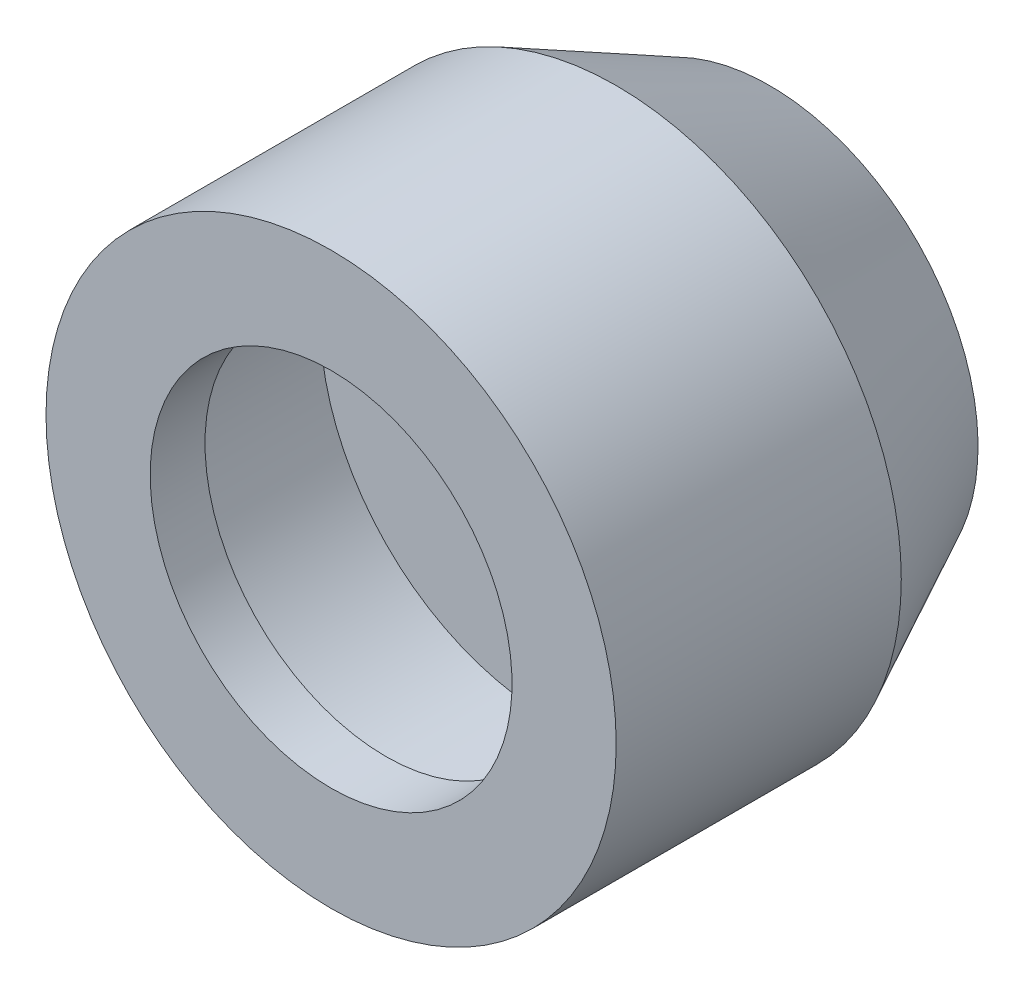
ISO-10303-21;
HEADER;
FILE_DESCRIPTION(('STEP AP214'),'2;1');
FILE_NAME('part.step','',(''),(''),'','','');
FILE_SCHEMA(('AUTOMOTIVE_DESIGN { 1 0 10303 214 1 1 1 1 }'));
ENDSEC;
DATA;
#1=APPLICATION_CONTEXT('core data for automotive mechanical design processes');
#2=APPLICATION_PROTOCOL_DEFINITION('international standard','automotive_design',2000,#1);
#3=PRODUCT_CONTEXT('',#1,'mechanical');
#4=PRODUCT('Part','Part','',(#3));
#5=PRODUCT_RELATED_PRODUCT_CATEGORY('part','',(#4));
#6=PRODUCT_DEFINITION_FORMATION('','',#4);
#7=PRODUCT_DEFINITION_CONTEXT('part definition',#1,'design');
#8=PRODUCT_DEFINITION('design','',#6,#7);
#9=PRODUCT_DEFINITION_SHAPE('','',#8);
#10=(LENGTH_UNIT() NAMED_UNIT(*) SI_UNIT(.MILLI.,.METRE.));
#11=(NAMED_UNIT(*) PLANE_ANGLE_UNIT() SI_UNIT($,.RADIAN.));
#12=(NAMED_UNIT(*) SI_UNIT($,.STERADIAN.) SOLID_ANGLE_UNIT());
#13=UNCERTAINTY_MEASURE_WITH_UNIT(LENGTH_MEASURE(1.E-05),#10,'distance_accuracy_value','');
#14=(GEOMETRIC_REPRESENTATION_CONTEXT(3) GLOBAL_UNCERTAINTY_ASSIGNED_CONTEXT((#13)) GLOBAL_UNIT_ASSIGNED_CONTEXT((#10,
#11,#12)) REPRESENTATION_CONTEXT('',''));
#15=CARTESIAN_POINT('',(0.,0.,0.));
#16=DIRECTION('',(0.,0.,1.));
#17=DIRECTION('',(1.,0.,0.));
#18=AXIS2_PLACEMENT_3D('',#15,#16,#17);
#19=CARTESIAN_POINT('',(0.,0.,10.));
#20=DIRECTION('',(0.,0.,1.));
#21=DIRECTION('',(0.,-1.,0.));
#22=AXIS2_PLACEMENT_3D('',#19,#20,#21);
#23=PLANE('',#22);
#24=CARTESIAN_POINT('',(0.,0.,10.));
#25=DIRECTION('',(0.,0.,1.));
#26=DIRECTION('',(0.,-1.,0.));
#27=AXIS2_PLACEMENT_3D('',#24,#25,#26);
#28=CIRCLE('',#27,10.5);
#29=CARTESIAN_POINT('',(0.,-10.5,10.));
#30=VERTEX_POINT('',#29);
#31=EDGE_CURVE('E8',#30,#30,#28,.T.);
#32=ORIENTED_EDGE('',*,*,#31,.T.);
#33=EDGE_LOOP('',(#32));
#34=FACE_BOUND('',#33,.T.);
#35=ADVANCED_FACE('F12',(#34),#23,.T.);
#36=CARTESIAN_POINT('',(0.,0.,0.));
#37=DIRECTION('',(0.,0.,1.));
#38=DIRECTION('',(0.,-1.,0.));
#39=AXIS2_PLACEMENT_3D('',#36,#37,#38);
#40=CYLINDRICAL_SURFACE('',#39,10.5);
#41=CARTESIAN_POINT('',(0.,0.,17.5));
#42=DIRECTION('',(0.,0.,1.));
#43=DIRECTION('',(0.,-1.,0.));
#44=AXIS2_PLACEMENT_3D('',#41,#42,#43);
#45=CIRCLE('',#44,10.5);
#46=CARTESIAN_POINT('',(0.,-10.5,17.5));
#47=VERTEX_POINT('',#46);
#48=EDGE_CURVE('E18',#47,#47,#45,.T.);
#49=ORIENTED_EDGE('',*,*,#48,.T.);
#50=EDGE_LOOP('',(#49));
#51=FACE_BOUND('',#50,.T.);
#52=ORIENTED_EDGE('',*,*,#31,.F.);
#53=EDGE_LOOP('',(#52));
#54=FACE_BOUND('',#53,.T.);
#55=ADVANCED_FACE('F55',(#51,#54),#40,.F.);
#56=CARTESIAN_POINT('',(10.5,0.,17.5));
#57=DIRECTION('',(0.,0.,-1.));
#58=DIRECTION('',(0.,1.,0.));
#59=AXIS2_PLACEMENT_3D('',#56,#57,#58);
#60=PLANE('',#59);
#61=CARTESIAN_POINT('',(0.,0.,17.5));
#62=DIRECTION('',(0.,0.,1.));
#63=DIRECTION('',(0.,-1.,0.));
#64=AXIS2_PLACEMENT_3D('',#61,#62,#63);
#65=CIRCLE('',#64,8.25);
#66=CARTESIAN_POINT('',(0.,-8.25,17.5));
#67=VERTEX_POINT('',#66);
#68=EDGE_CURVE('E22',#67,#67,#65,.T.);
#69=ORIENTED_EDGE('',*,*,#68,.T.);
#70=EDGE_LOOP('',(#69));
#71=FACE_BOUND('',#70,.T.);
#72=ORIENTED_EDGE('',*,*,#48,.F.);
#73=EDGE_LOOP('',(#72));
#74=FACE_BOUND('',#73,.T.);
#75=ADVANCED_FACE('F60',(#71,#74),#60,.T.);
#76=CARTESIAN_POINT('',(0.,0.,0.));
#77=DIRECTION('',(0.,0.,1.));
#78=DIRECTION('',(0.,-1.,0.));
#79=AXIS2_PLACEMENT_3D('',#76,#77,#78);
#80=CYLINDRICAL_SURFACE('',#79,8.25);
#81=CARTESIAN_POINT('',(0.,0.,20.));
#82=DIRECTION('',(0.,0.,1.));
#83=DIRECTION('',(0.,-1.,0.));
#84=AXIS2_PLACEMENT_3D('',#81,#82,#83);
#85=CIRCLE('',#84,8.25);
#86=CARTESIAN_POINT('',(0.,-8.25,20.));
#87=VERTEX_POINT('',#86);
#88=EDGE_CURVE('E26',#87,#87,#85,.T.);
#89=ORIENTED_EDGE('',*,*,#88,.T.);
#90=EDGE_LOOP('',(#89));
#91=FACE_BOUND('',#90,.T.);
#92=ORIENTED_EDGE('',*,*,#68,.F.);
#93=EDGE_LOOP('',(#92));
#94=FACE_BOUND('',#93,.T.);
#95=ADVANCED_FACE('F65',(#91,#94),#80,.F.);
#96=CARTESIAN_POINT('',(8.25,0.,20.));
#97=DIRECTION('',(0.,0.,1.));
#98=DIRECTION('',(0.,-1.,0.));
#99=AXIS2_PLACEMENT_3D('',#96,#97,#98);
#100=PLANE('',#99);
#101=CARTESIAN_POINT('',(0.,0.,20.));
#102=DIRECTION('',(0.,0.,1.));
#103=DIRECTION('',(0.,-1.,0.));
#104=AXIS2_PLACEMENT_3D('',#101,#102,#103);
#105=CIRCLE('',#104,13.);
#106=CARTESIAN_POINT('',(0.,-13.,20.));
#107=VERTEX_POINT('',#106);
#108=EDGE_CURVE('E31',#107,#107,#105,.T.);
#109=ORIENTED_EDGE('',*,*,#108,.T.);
#110=EDGE_LOOP('',(#109));
#111=FACE_BOUND('',#110,.T.);
#112=ORIENTED_EDGE('',*,*,#88,.F.);
#113=EDGE_LOOP('',(#112));
#114=FACE_BOUND('',#113,.T.);
#115=ADVANCED_FACE('F72',(#111,#114),#100,.T.);
#116=CARTESIAN_POINT('',(0.,0.,0.));
#117=DIRECTION('',(0.,0.,1.));
#118=DIRECTION('',(0.,-1.,0.));
#119=AXIS2_PLACEMENT_3D('',#116,#117,#118);
#120=CYLINDRICAL_SURFACE('',#119,13.);
#121=CARTESIAN_POINT('',(0.,0.,7.));
#122=DIRECTION('',(0.,0.,1.));
#123=DIRECTION('',(0.,-1.,0.));
#124=AXIS2_PLACEMENT_3D('',#121,#122,#123);
#125=CIRCLE('',#124,13.);
#126=CARTESIAN_POINT('',(0.,-13.,7.));
#127=VERTEX_POINT('',#126);
#128=EDGE_CURVE('E34',#127,#127,#125,.T.);
#129=ORIENTED_EDGE('',*,*,#128,.T.);
#130=EDGE_LOOP('',(#129));
#131=FACE_BOUND('',#130,.T.);
#132=ORIENTED_EDGE('',*,*,#108,.F.);
#133=EDGE_LOOP('',(#132));
#134=FACE_BOUND('',#133,.T.);
#135=ADVANCED_FACE('F52',(#131,#134),#120,.T.);
#136=CARTESIAN_POINT('',(0.,0.,7.));
#137=DIRECTION('',(0.,0.,1.));
#138=DIRECTION('',(0.,-1.,0.));
#139=AXIS2_PLACEMENT_3D('',#136,#137,#138);
#140=CONICAL_SURFACE('',#139,13.,0.463647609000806);
#141=CARTESIAN_POINT('',(0.,0.,0.));
#142=DIRECTION('',(0.,0.,1.));
#143=DIRECTION('',(0.,-1.,0.));
#144=AXIS2_PLACEMENT_3D('',#141,#142,#143);
#145=CIRCLE('',#144,9.5);
#146=CARTESIAN_POINT('',(0.,-9.5,0.));
#147=VERTEX_POINT('',#146);
#148=EDGE_CURVE('E37',#147,#147,#145,.T.);
#149=ORIENTED_EDGE('',*,*,#148,.T.);
#150=EDGE_LOOP('',(#149));
#151=FACE_BOUND('',#150,.T.);
#152=ORIENTED_EDGE('',*,*,#128,.F.);
#153=EDGE_LOOP('',(#152));
#154=FACE_BOUND('',#153,.T.);
#155=ADVANCED_FACE('F41',(#151,#154),#140,.T.);
#156=CARTESIAN_POINT('',(9.5,0.,0.));
#157=DIRECTION('',(0.,0.,-1.));
#158=DIRECTION('',(0.,1.,0.));
#159=AXIS2_PLACEMENT_3D('',#156,#157,#158);
#160=PLANE('',#159);
#161=ORIENTED_EDGE('',*,*,#148,.F.);
#162=EDGE_LOOP('',(#161));
#163=FACE_BOUND('',#162,.T.);
#164=ADVANCED_FACE('F44',(#163),#160,.T.);
#165=CLOSED_SHELL('',(#35,#55,#75,#95,#115,#135,#155,#164));
#166=MANIFOLD_SOLID_BREP('B1',#165);
#167=ADVANCED_BREP_SHAPE_REPRESENTATION('',(#18,#166),#14);
#168=SHAPE_DEFINITION_REPRESENTATION(#9,#167);
ENDSEC;
END-ISO-10303-21;
